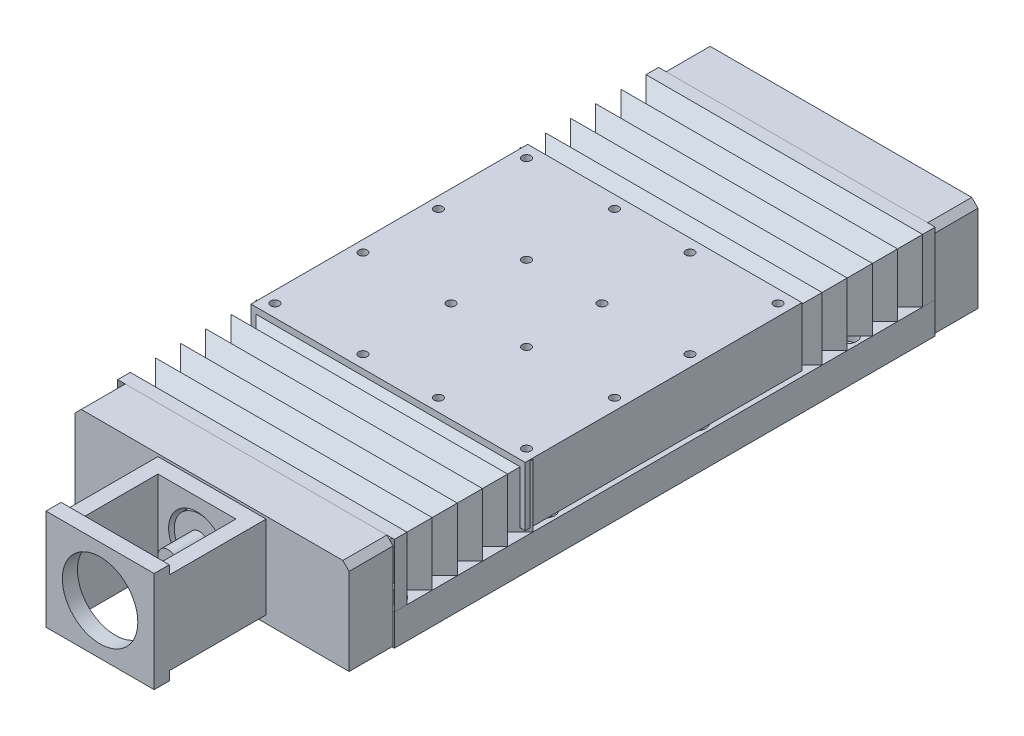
from build123d import *

# Parameters (mm, degrees)
EXTRUDE_1_DEPTH              = 430
SKETCH_2_W                   = 140
SKETCH_2_H                   = 1
CUT_EXTRUDE_1_DEPTH          = 445.135114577
SKETCH_4_W                   = 20
SKETCH_4_H                   = 430
EXTRUDE_2_DEPTH              = 30
EXTRUDE_2_2_DEPTH            = 30
EXTRUDE_3_DEPTH              = 110
SKETCH_6_W                   = 66
SKETCH_6_H                   = 43
EXTRUDE_4_DEPTH              = 100
SKETCH_7_R                   = 15
CUT_EXTRUDE_2_DEPTH          = 349.491032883
SKETCH_8_R                   = 20
CUT_EXTRUDE_3_DEPTH          = 65
SKETCH_9_W                   = 218
SKETCH_9_H                   = 74
EXTRUDE_5_DEPTH              = 35
SKETCH_10_R                  = 12.5
EXTRUDE_6_DEPTH              = 465
SKETCH_12_R                  = 8
EXTRUDE_7_DEPTH              = 35
EXTRUDE_START                = 10
SKETCH_13_R                  = 20
EXTRUDE_8_DEPTH              = 10
CHAMFER_2_SIZE               = 5
CHAMFER_3_SIZE               = 5
SKETCH_16_W                  = 86
SKETCH_16_H                  = 66
SKETCH_16_R                  = 22.5
EXTRUDE_9_DEPTH              = 12
SKETCH_17_W                  = 12
SKETCH_17_H                  = 66
EXTRUDE_10_DEPTH             = 65
SKETCH_18_W                  = 86
SKETCH_18_H                  = 80
SKETCH_18_R                  = 30
EXTRUDE_11_DEPTH             = 12
HOLE_WIZARD_M8_1_AT_2_COUNT  = 2
HOLE_WIZARD_M8_1_AT_2_PITCH  = 70
HOLE_WIZARD_M8_1_AT_3_COUNT  = 2
HOLE_WIZARD_M8_1_AT_3_PITCH  = 70
HOLE_WIZARD_M8_1_AT_4_COUNT  = 2
HOLE_WIZARD_M8_1_AT_4_PITCH  = 98.994949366
HOLE_WIZARD_M8_1_AT_5_COUNT  = 2
HOLE_WIZARD_M8_1_AT_5_PITCH  = 147.648230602
HOLE_WIZARD_M8_1_AT_6_COUNT  = 2
HOLE_WIZARD_M8_1_AT_6_PITCH  = 130
HOLE_WIZARD_M8_1_AT_7_COUNT  = 2
HOLE_WIZARD_M8_1_AT_7_PITCH  = 211.896201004
HOLE_WIZARD_M8_1_AT_8_COUNT  = 2
HOLE_WIZARD_M8_1_AT_8_PITCH  = 200
HOLE_WIZARD_M8_1_AT_9_COUNT  = 2
HOLE_WIZARD_M8_1_AT_9_PITCH  = 238.537208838
HOLE_WIZARD_M8_1_AT_10_COUNT = 2
HOLE_WIZARD_M8_1_AT_10_PITCH = 282.842712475
HOLE_WIZARD_M8_1_AT_11_COUNT = 2
HOLE_WIZARD_M8_1_AT_11_PITCH = 238.537208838
HOLE_WIZARD_M8_1_AT_12_COUNT = 2
HOLE_WIZARD_M8_1_AT_12_PITCH = 183.847763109
HOLE_WIZARD_M8_1_AT_13_COUNT = 2
HOLE_WIZARD_M8_1_AT_13_PITCH = 147.648230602
HOLE_WIZARD_M8_1_AT_14_COUNT = 2
HOLE_WIZARD_M8_1_AT_14_PITCH = 211.896201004
HOLE_WIZARD_M8_1_AT_15_COUNT = 2
HOLE_WIZARD_M8_1_AT_15_PITCH = 200
HOLE_WIZARD_M8_1_AT_16_COUNT = 2
HOLE_WIZARD_M8_1_AT_16_PITCH = 130
PATTERN_LINEAR_1_COUNT       = 4
PATTERN_LINEAR_1_PITCH       = 120


with BuildPart() as part:
    # Sketch 1 → Extrude 1 (new body)
    with BuildSketch(Plane.XY):
        Polygon((51.5, 0), (-51.5, 0), (-51.5, 16), (-70, 16), (-70, 13), (-90, 13), (-90, 11), (-110, 11), (-110, -14), (110, -14), (110, 11), (90, 11), (90, 13), (70, 13), (70, 16), (51.5, 16), align=None)
    extrude(amount=EXTRUDE_1_DEPTH)

    # Sketch 2 → Cut-Extrude 1 (cut, through all)
    with BuildSketch(Plane.XY.offset(430)):
        with Locations((0, -13.5)):
            Rectangle(SKETCH_2_W, SKETCH_2_H)
    extrude(amount=-CUT_EXTRUDE_1_DEPTH, mode=Mode.SUBTRACT)



with BuildPart() as body_2:
    # Sketch 4 → Extrude 2 (new body)
    with BuildSketch(Plane(origin=(0, 13, 0), x_dir=(1, 0, 0), z_dir=(0, 1, 0))):
        with Locations((-80, -215)):
            Rectangle(SKETCH_4_W, SKETCH_4_H)
    extrude(amount=EXTRUDE_2_DEPTH)


with BuildPart() as body_3:
    # Sketch 4 → Extrude 2 2 (new body)
    with BuildSketch(Plane(origin=(0, 13, 0), x_dir=(1, 0, 0), z_dir=(0, 1, 0))):
        with Locations((80, -215)):
            Rectangle(SKETCH_4_W, SKETCH_4_H)
    extrude(amount=EXTRUDE_2_2_DEPTH)


with BuildPart() as part_1:
    add(part.part)

    add(body_3.part)  # Extrude 3 merges body 3

    add(body_2.part)  # Extrude 3 merges body 2
    # Sketch 5 → Extrude 3 (add, symmetric)
    with BuildSketch(Plane.XY.offset(215)):
        Polygon((-80, 61), (80, 61), (109, 61), (109, 14), (101, 14), (101, 43), (90, 43), (70, 43), (59, 43), (59, 41), (33, 41), (33, 43), (-33, 43), (-33, 41), (-59, 41), (-59, 43), (-70, 43), (-90, 43), (-101, 43), (-101, 14), (-109, 14), (-109, 61), align=None)
    extrude(amount=EXTRUDE_3_DEPTH, both=True)

    # Sketch 6 → Extrude 4 (add)
    with BuildSketch(Plane.XY.offset(325)):
        with Locations((0, 21.5)):
            Rectangle(SKETCH_6_W, SKETCH_6_H)
    extrude(amount=-EXTRUDE_4_DEPTH)

    # Sketch 7 → Cut-Extrude 2 (cut, through all)
    with BuildSketch(Plane.XY.offset(325)):
        with Locations((0, 26)):
            Circle(SKETCH_7_R)
    extrude(amount=-CUT_EXTRUDE_2_DEPTH, mode=Mode.SUBTRACT)

    # Sketch 8 → Cut-Extrude 3 (cut)
    with BuildSketch(Plane.XY.offset(325)):
        with Locations((0, 26)):
            Circle(SKETCH_8_R)
    extrude(amount=-CUT_EXTRUDE_3_DEPTH, mode=Mode.SUBTRACT)

    # Sketch 24 → Hole Wizard M8 _1 (revolve, cut)
    with BuildSketch(Plane(origin=(-100, 61, 115), x_dir=(0, 0, 1), z_dir=(1, 0, 0))):
        Polygon((0, 0), (0, 24.292926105), (3.4, 22.25), (3.4, 0), align=None)
    hole_wizard_m8_1 = revolve(axis=Axis((-100, 67.35, 115), (0, -1, 0)), mode=Mode.SUBTRACT)

    # Hole Wizard M8 _1 at 2: Hole Wizard M8 _1 ×2
    with Locations(*[(i * HOLE_WIZARD_M8_1_AT_2_PITCH, 0, 0) for i in range(1, HOLE_WIZARD_M8_1_AT_2_COUNT)]):
        add(hole_wizard_m8_1, mode=Mode.SUBTRACT)

    # Hole Wizard M8 _1 at 3: Hole Wizard M8 _1 ×2
    with Locations(*[(0, 0, i * HOLE_WIZARD_M8_1_AT_3_PITCH) for i in range(1, HOLE_WIZARD_M8_1_AT_3_COUNT)]):
        add(hole_wizard_m8_1, mode=Mode.SUBTRACT)

    # Hole Wizard M8 _1 at 4: Hole Wizard M8 _1 ×2
    with Locations(*[Vector(0.7071067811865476, 0, 0.7071067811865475) * (i * HOLE_WIZARD_M8_1_AT_4_PITCH) for i in range(1, HOLE_WIZARD_M8_1_AT_4_COUNT)]):
        add(hole_wizard_m8_1, mode=Mode.SUBTRACT)

    # Hole Wizard M8 _1 at 5: Hole Wizard M8 _1 ×2
    with Locations(*[Vector(0.8804710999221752, 0, 0.47409982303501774) * (i * HOLE_WIZARD_M8_1_AT_5_PITCH) for i in range(1, HOLE_WIZARD_M8_1_AT_5_COUNT)]):
        add(hole_wizard_m8_1, mode=Mode.SUBTRACT)

    # Hole Wizard M8 _1 at 6: Hole Wizard M8 _1 ×2
    with Locations(*[(i * HOLE_WIZARD_M8_1_AT_6_PITCH, 0, 0) for i in range(1, HOLE_WIZARD_M8_1_AT_6_COUNT)]):
        add(hole_wizard_m8_1, mode=Mode.SUBTRACT)

    # Hole Wizard M8 _1 at 7: Hole Wizard M8 _1 ×2
    with Locations(*[Vector(0.9438583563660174, 0, 0.33035042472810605) * (i * HOLE_WIZARD_M8_1_AT_7_PITCH) for i in range(1, HOLE_WIZARD_M8_1_AT_7_COUNT)]):
        add(hole_wizard_m8_1, mode=Mode.SUBTRACT)

    # Hole Wizard M8 _1 at 8: Hole Wizard M8 _1 ×2
    with Locations(*[(i * HOLE_WIZARD_M8_1_AT_8_PITCH, 0, 0) for i in range(1, HOLE_WIZARD_M8_1_AT_8_COUNT)]):
        add(hole_wizard_m8_1, mode=Mode.SUBTRACT)

    # Hole Wizard M8 _1 at 9: Hole Wizard M8 _1 ×2
    with Locations(*[Vector(0.8384436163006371, 0, 0.5449883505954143) * (i * HOLE_WIZARD_M8_1_AT_9_PITCH) for i in range(1, HOLE_WIZARD_M8_1_AT_9_COUNT)]):
        add(hole_wizard_m8_1, mode=Mode.SUBTRACT)

    # Hole Wizard M8 _1 at 10: Hole Wizard M8 _1 ×2
    with Locations(*[Vector(0.7071067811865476, 0, 0.7071067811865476) * (i * HOLE_WIZARD_M8_1_AT_10_PITCH) for i in range(1, HOLE_WIZARD_M8_1_AT_10_COUNT)]):
        add(hole_wizard_m8_1, mode=Mode.SUBTRACT)

    # Hole Wizard M8 _1 at 11: Hole Wizard M8 _1 ×2
    with Locations(*[Vector(0.5449883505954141, 0, 0.8384436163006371) * (i * HOLE_WIZARD_M8_1_AT_11_PITCH) for i in range(1, HOLE_WIZARD_M8_1_AT_11_COUNT)]):
        add(hole_wizard_m8_1, mode=Mode.SUBTRACT)

    # Hole Wizard M8 _1 at 12: Hole Wizard M8 _1 ×2
    with Locations(*[Vector(0.7071067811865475, 0, 0.7071067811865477) * (i * HOLE_WIZARD_M8_1_AT_12_PITCH) for i in range(1, HOLE_WIZARD_M8_1_AT_12_COUNT)]):
        add(hole_wizard_m8_1, mode=Mode.SUBTRACT)

    # Hole Wizard M8 _1 at 13: Hole Wizard M8 _1 ×2
    with Locations(*[Vector(0.4740998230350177, 0, 0.8804710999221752) * (i * HOLE_WIZARD_M8_1_AT_13_PITCH) for i in range(1, HOLE_WIZARD_M8_1_AT_13_COUNT)]):
        add(hole_wizard_m8_1, mode=Mode.SUBTRACT)

    # Hole Wizard M8 _1 at 14: Hole Wizard M8 _1 ×2
    with Locations(*[Vector(0.33035042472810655, 0, 0.9438583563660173) * (i * HOLE_WIZARD_M8_1_AT_14_PITCH) for i in range(1, HOLE_WIZARD_M8_1_AT_14_COUNT)]):
        add(hole_wizard_m8_1, mode=Mode.SUBTRACT)

    # Hole Wizard M8 _1 at 15: Hole Wizard M8 _1 ×2
    with Locations(*[(0, 0, i * HOLE_WIZARD_M8_1_AT_15_PITCH) for i in range(1, HOLE_WIZARD_M8_1_AT_15_COUNT)]):
        add(hole_wizard_m8_1, mode=Mode.SUBTRACT)

    # Hole Wizard M8 _1 at 16: Hole Wizard M8 _1 ×2
    with Locations(*[(0, 0, i * HOLE_WIZARD_M8_1_AT_16_PITCH) for i in range(1, HOLE_WIZARD_M8_1_AT_16_COUNT)]):
        add(hole_wizard_m8_1, mode=Mode.SUBTRACT)

    # Sketch 26 → Hole Wizard 1 (revolve, cut)
    with BuildSketch(Plane(origin=(-100, 11, 60), x_dir=(0, 0, 1), z_dir=(1, 0, 0))):
        Polygon((0, 0), (0, 25), (4.5, 25), (4.5, 9), (7.5, 9), (7.5, 0), align=None)
    hole_wizard_1 = revolve(axis=Axis((-100, 17.35, 60), (0, -1, 0)), mode=Mode.SUBTRACT)

    # Pattern Linear 1: Hole Wizard 1 ×4
    with Locations(*[(0, 0, i * PATTERN_LINEAR_1_PITCH) for i in range(1, PATTERN_LINEAR_1_COUNT)]):
        add(hole_wizard_1, mode=Mode.SUBTRACT)

    # Mirror 3: Hole Wizard 1 across plane
    add(hole_wizard_1.mirror(Plane.ZY), mode=Mode.SUBTRACT)

    # Mirror 3 copy 1 sketch → Mirror 3 copy 1 (revolve, cut)
    with BuildSketch(Plane(origin=(100, 11, 180), x_dir=(0, 0, 1), z_dir=(-1, 0, 0))):
        Polygon((0, 0), (0, -25), (4.5, -25), (4.5, -9), (7.5, -9), (7.5, 0), align=None)
    revolve(axis=Axis((100, 17.35, 180), (0, 1, 0)), mode=Mode.SUBTRACT)

    # Mirror 3 copy 2 sketch → Mirror 3 copy 2 (revolve, cut)
    with BuildSketch(Plane(origin=(100, 11, 300), x_dir=(0, 0, 1), z_dir=(-1, 0, 0))):
        Polygon((0, 0), (0, -25), (4.5, -25), (4.5, -9), (7.5, -9), (7.5, 0), align=None)
    revolve(axis=Axis((100, 17.35, 300), (0, 1, 0)), mode=Mode.SUBTRACT)

    # Mirror 3 copy 3 sketch → Mirror 3 copy 3 (revolve, cut)
    with BuildSketch(Plane(origin=(100, 11, 420), x_dir=(0, 0, 1), z_dir=(-1, 0, 0))):
        Polygon((0, 0), (0, -25), (4.5, -25), (4.5, -9), (7.5, -9), (7.5, 0), align=None)
    revolve(axis=Axis((100, 17.35, 420), (0, 1, 0)), mode=Mode.SUBTRACT)


with BuildPart() as body_2_2:
    # Sketch 9 → Extrude 5 (new body)
    with BuildSketch(Plane.XY.offset(430)):
        with Locations((0, 24)):
            Rectangle(SKETCH_9_W, SKETCH_9_H)
    extrude(amount=EXTRUDE_5_DEPTH)


with BuildPart() as body_3_2:
    # Mirror 1: mirrored copy
    add(body_2_2.part.mirror(Plane.XY.offset(215)))

    # Chamfer 2
    chamfer_2_edges = [body_3_2.edges().sort_by_distance(p)[0] for p in [
        (-109, 61, -17.5),
        (109, 61, -17.5),
    ]]
    chamfer(chamfer_2_edges, length=CHAMFER_2_SIZE)


with BuildPart() as body_4:
    # Sketch 10 → Extrude 6 (new body)
    with BuildSketch(Plane.XY):
        with Locations((0, 26)):
            Circle(SKETCH_10_R)
    extrude(amount=EXTRUDE_6_DEPTH)


with BuildPart() as body_2_2_1:
    add(body_2_2.part)

    add(body_4.part)  # Extrude 7 merges body 4
    # Sketch 12 → Extrude 7 (add)
    with BuildSketch(Plane.XY.offset(465)):
        with Locations((0, 26)):
            Circle(SKETCH_12_R)
    extrude(amount=EXTRUDE_7_DEPTH)

    # Sketch 13 → Extrude 8 (add)
    with BuildSketch(Plane.XY.offset(465).offset(EXTRUDE_START)):
        with Locations((0, 26)):
            Circle(SKETCH_13_R)
    extrude(amount=-EXTRUDE_8_DEPTH)

    # Chamfer 3
    chamfer_3_edges = [body_2_2_1.edges().sort_by_distance(p)[0] for p in [
        (-109, 61, 447.5),
        (109, 61, 447.5),
    ]]
    chamfer(chamfer_3_edges, length=CHAMFER_3_SIZE)

    # Sketch 16 → Extrude 9 (add)
    with BuildSketch(Plane.XY.offset(465)):
        with Locations((0, 26)):
            Rectangle(SKETCH_16_W, SKETCH_16_H)
        with Locations((0, 26)):
            Circle(SKETCH_16_R, mode=Mode.SUBTRACT)
    extrude(amount=EXTRUDE_9_DEPTH)

    # Sketch 17 → Extrude 10 (add)
    with BuildSketch(Plane.XY.offset(477)):
        with Locations((-37, 26)):
            Rectangle(SKETCH_17_W, SKETCH_17_H)
        with Locations((37, 26)):
            Rectangle(SKETCH_17_W, SKETCH_17_H)
    extrude(amount=EXTRUDE_10_DEPTH)

    # Sketch 18 → Extrude 11 (add)
    with BuildSketch(Plane.XY.offset(542)):
        with Locations((0, 26)):
            Rectangle(SKETCH_18_W, SKETCH_18_H)
        with Locations((0, 26)):
            Circle(SKETCH_18_R, mode=Mode.SUBTRACT)
    extrude(amount=EXTRUDE_11_DEPTH)


solid = Compound([part_1.part, body_3_2.part, body_2_2_1.part])
